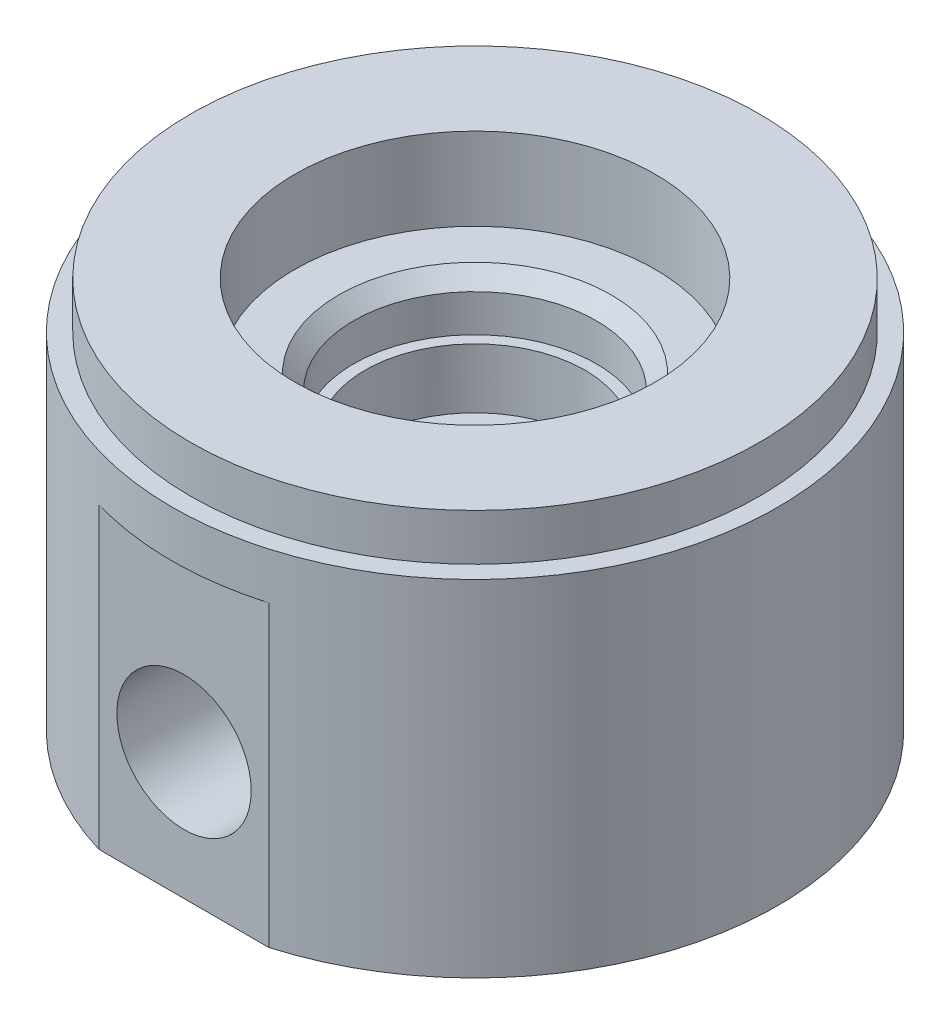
from build123d import *

# Parameters (mm, degrees)
SKETCH1_R                 = 20.6375
EXTRUDE1_DEPTH            = 26.67
SKETCH2_OUTSIDE_W         = 56.11
SKETCH2_OUTSIDE_H         = 56.11
SKETCH2_OUTSIDE_R         = 19.3675
CUT_EXTRUDE3_DEPTH        = 3.175
SKETCH3_R                 = 12.2682
CUT_EXTRUDE4_DEPTH        = 5.6134
SKETCH4_R                 = 8.255
CUT_EXTRUDE5_DEPTH        = 3.556
SKETCH5_R                 = 7.493
CUT_EXTRUDE6_DEPTH        = 7.62
SKETCH6_R                 = 0.254
CENTER_HOLE_DEPTH         = 7.62
CHAMFER1_SIZE             = 1.016
SKETCH7_W                 = 12.7
SKETCH7_H                 = 20.32
HI_P_FLAT_DEPTH           = 2.54
SKETCH8_R                 = 4.572
HI_P_PORT_DEPTH           = 11.43
SKETCH9_R                 = 4.1275
LOW_P_PORT_DEPTH          = 11.43
SKETCH10_R                = 1.5875
LOW_P_HOLE_DEPTH          = 10.16
HI_P_THRU_HOLE_DEPTH      = 7.62
HI_P_THRU_HOLE_DEPTH_BACK = 7.62
SKETCH13_R                = 1.5875
CHAMFER2_SIZE             = 0.2794
CHAMFER2_SIZE2            = 0.483934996
SKETCH14_R                = 1.9812
MOUNT_HOLES_DEPTH         = 11.43


with BuildPart() as part:
    # Sketch1 → Extrude1 (new body)
    with BuildSketch(Plane(origin=(0, 0, 0), x_dir=(1, 0, 0), z_dir=(0, 1, 0))):
        with Locations(Location((0, 0, 0), (0, 0, 270))):
            Circle(SKETCH1_R)
    extrude(amount=EXTRUDE1_DEPTH)

    # Sketch2 outside → Cut-Extrude3 (cut)
    with BuildSketch(Plane(origin=(0, 26.67, 0), x_dir=(-1, 0, 0), z_dir=(0, 1, 0))):
        Rectangle(SKETCH2_OUTSIDE_W, SKETCH2_OUTSIDE_H)
        with Locations(Location((0, 0, 0), (0, 0, 90))):
            Circle(SKETCH2_OUTSIDE_R, mode=Mode.SUBTRACT)
    extrude(amount=-CUT_EXTRUDE3_DEPTH, mode=Mode.SUBTRACT)

    # Sketch3 → Cut-Extrude4 (cut)
    with BuildSketch(Plane(origin=(0, 26.67, 0), x_dir=(-1, 0, 0), z_dir=(0, 1, 0))):
        with Locations(Location((0, 0, 0), (0, 0, 90))):
            Circle(SKETCH3_R)
    extrude(amount=-CUT_EXTRUDE4_DEPTH, mode=Mode.SUBTRACT)

    # Sketch4 → Cut-Extrude5 (cut)
    with BuildSketch(Plane(origin=(0, 21.0566, 0), x_dir=(-1, 0, 0), z_dir=(0, 1, 0))):
        with Locations(Location((0, 0, 0), (0, 0, 90))):
            Circle(SKETCH4_R)
    extrude(amount=-CUT_EXTRUDE5_DEPTH, mode=Mode.SUBTRACT)

    # Sketch5 → Cut-Extrude6 (cut)
    with BuildSketch(Plane(origin=(0, 21.0566, 0), x_dir=(-1, 0, 0), z_dir=(0, 1, 0))):
        with Locations(Location((0, 0, 0), (0, 0, 90))):
            Circle(SKETCH5_R)
    extrude(amount=-CUT_EXTRUDE6_DEPTH, mode=Mode.SUBTRACT)

    # Sketch6 → center_hole (cut)
    with BuildSketch(Plane(origin=(0, 13.4366, 0), x_dir=(-1, 0, 0), z_dir=(0, 1, 0))):
        with Locations(Location((0, 0, 0), (0, 0, 90))):
            Circle(SKETCH6_R)
    extrude(amount=-CENTER_HOLE_DEPTH, mode=Mode.SUBTRACT)

    # Chamfer1
    chamfer1_edges = [part.edges().sort_by_distance(p)[0] for p in [
        (0, 21.0566, -8.255),
    ]]
    chamfer(chamfer1_edges, length=CHAMFER1_SIZE)

    # Sketch7 → hi_p_flat (cut)
    with BuildSketch(Plane.XY.offset(19.812)):
        with Locations((0, 10.16)):
            Rectangle(SKETCH7_W, SKETCH7_H)
    extrude(amount=HI_P_FLAT_DEPTH, mode=Mode.SUBTRACT)

    # Sketch8 → hi_p_port (cut)
    with BuildSketch(Plane.XY.offset(19.812)):
        with Locations((0, 8.636)):
            Circle(SKETCH8_R)
    extrude(amount=-HI_P_PORT_DEPTH, mode=Mode.SUBTRACT)

    # Sketch9 → low_p_port (cut)
    with BuildSketch(Plane.XY.offset(-20.828)):
        with Locations(Location((0, 8.636, 0), (0, 0, 90))):
            Circle(SKETCH9_R)
    extrude(amount=LOW_P_PORT_DEPTH, mode=Mode.SUBTRACT)

    # Sketch10 → low_p_hole (cut)
    with BuildSketch(Plane(origin=(0, 0, -9.398), x_dir=(-1, 0, 0), z_dir=(0, 0, -1))):
        with Locations((0, 6.604)):
            Circle(SKETCH10_R)
    extrude(amount=-LOW_P_HOLE_DEPTH, mode=Mode.SUBTRACT)

    # Sketch13 → hi_p_thru_hole (cut, two sides: drawn at the far end of the back side and taken through both)
    with BuildSketch(Plane(origin=(-0.206117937, 5.447255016, -3.860889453), x_dir=(0.9995166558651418, 0.027365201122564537, -0.014751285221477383), z_dir=(0.030856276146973, -0.8154652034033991, 0.5779830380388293)).offset(-HI_P_THRU_HOLE_DEPTH_BACK)):
        with Locations(Location((0.206140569, 13.806560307, 0), (0, 0, 85.579372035))):
            Circle(SKETCH13_R)
    extrude(amount=HI_P_THRU_HOLE_DEPTH + HI_P_THRU_HOLE_DEPTH_BACK, mode=Mode.SUBTRACT)

    # Chamfer2
    chamfer2_edges = [part.edges().sort_by_distance(p)[0] for p in [
        (0, 13.4366, -0.254),
    ]]
    chamfer2_side = [part.faces().sort_by_distance(p)[0] for p in [
        (1.55443341, 13.4366, 7.325285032),
    ]]
    chamfer(chamfer2_edges, length=CHAMFER2_SIZE, length2=CHAMFER2_SIZE2, reference=chamfer2_side[0])

    # Sketch14 → mount_holes (cut)
    with BuildSketch(Plane.XZ):
        with Locations(Location((11.225320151, 11.225320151, 0), (0, 0, 270))):
            Circle(SKETCH14_R)
        with Locations(Location((-11.225320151, -11.225320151, 0), (0, 0, 90))):
            Circle(SKETCH14_R)
    extrude(amount=-MOUNT_HOLES_DEPTH, mode=Mode.SUBTRACT)


solid = part.part
